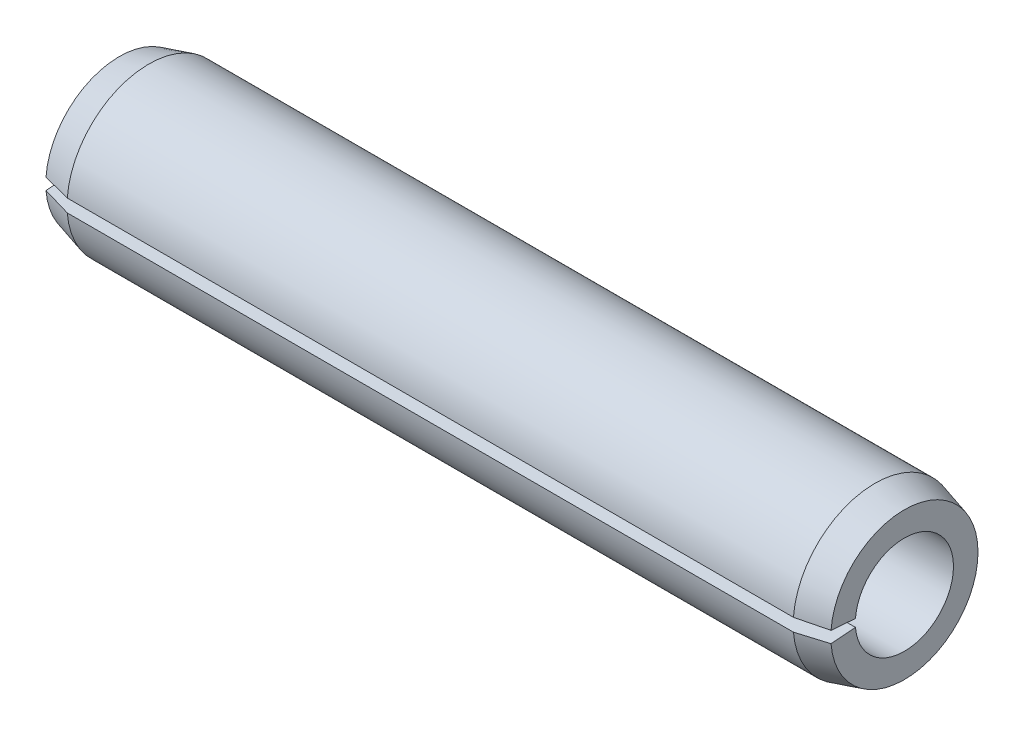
from build123d import *

# Parameters (mm, degrees)
GAP_DEPTH = 25.259018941


with BuildPart() as part:
    # Sketch1 → Base-Revolve (revolve)
    with BuildSketch(Plane.XY, mode=Mode.PRIVATE) as base_revolve_sk:
        Polygon((0, 1.5), (24, 1.5), (24, 2.25), (23.1, 2.5), (0.9, 2.5), (0, 2.25), align=None)
    revolve(base_revolve_sk.sketch.rotate(Axis((-9.525, 0, 0), (1, 0, 0)), 90), axis=Axis((-9.525, 0, 0), (1, 0, 0)))

    # Sketch2 → Gap (cut, through all)
    with BuildSketch(Plane(origin=(0, 0, 0), x_dir=(0, -1, 0), z_dir=(-1, 0, 0))):
        with BuildLine():
            Line((0, 0), (0.200070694, 2.542139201))
            ThreePointArc((0.200070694, 2.542139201), (0, 2.55), (-0.200070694, 2.542139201))
            Line((-0.200070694, 2.542139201), (0, 0))
        make_face()
    extrude(amount=-GAP_DEPTH, mode=Mode.SUBTRACT)


solid = part.part
